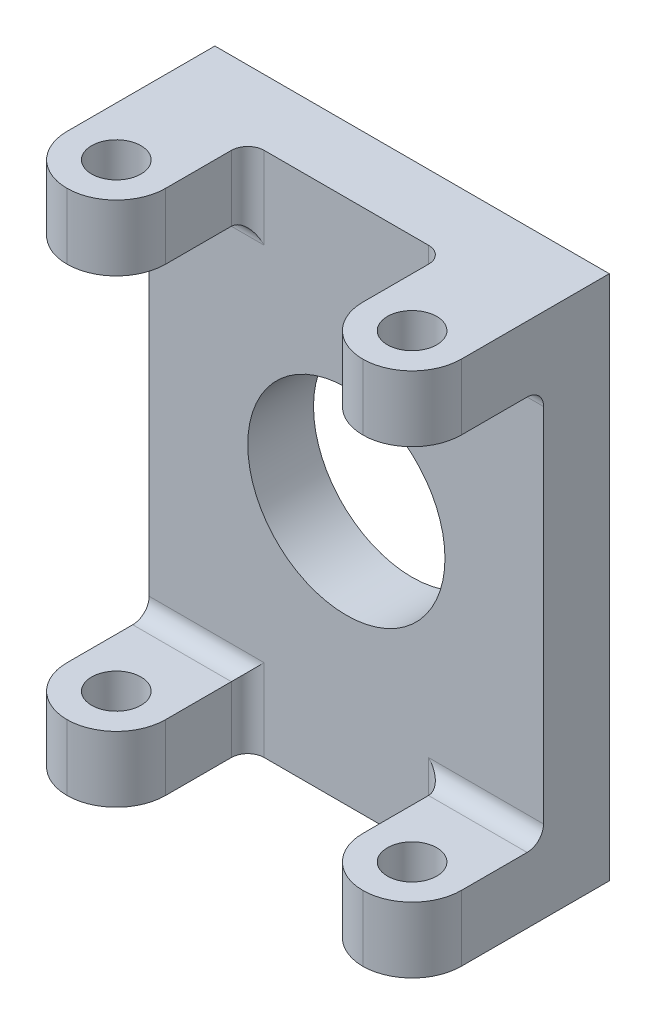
ISO-10303-21;
HEADER;
FILE_DESCRIPTION(('STEP AP214'),'2;1');
FILE_NAME('part.step','',(''),(''),'','','');
FILE_SCHEMA(('AUTOMOTIVE_DESIGN { 1 0 10303 214 1 1 1 1 }'));
ENDSEC;
DATA;
#1=APPLICATION_CONTEXT('core data for automotive mechanical design processes');
#2=APPLICATION_PROTOCOL_DEFINITION('international standard','automotive_design',2000,#1);
#3=PRODUCT_CONTEXT('',#1,'mechanical');
#4=PRODUCT('Part','Part','',(#3));
#5=PRODUCT_RELATED_PRODUCT_CATEGORY('part','',(#4));
#6=PRODUCT_DEFINITION_FORMATION('','',#4);
#7=PRODUCT_DEFINITION_CONTEXT('part definition',#1,'design');
#8=PRODUCT_DEFINITION('design','',#6,#7);
#9=PRODUCT_DEFINITION_SHAPE('','',#8);
#10=(LENGTH_UNIT() NAMED_UNIT(*) SI_UNIT(.MILLI.,.METRE.));
#11=(NAMED_UNIT(*) PLANE_ANGLE_UNIT() SI_UNIT($,.RADIAN.));
#12=(NAMED_UNIT(*) SI_UNIT($,.STERADIAN.) SOLID_ANGLE_UNIT());
#13=UNCERTAINTY_MEASURE_WITH_UNIT(LENGTH_MEASURE(1.E-05),#10,'distance_accuracy_value','');
#14=(GEOMETRIC_REPRESENTATION_CONTEXT(3) GLOBAL_UNCERTAINTY_ASSIGNED_CONTEXT((#13)) GLOBAL_UNIT_ASSIGNED_CONTEXT((#10,
#11,#12)) REPRESENTATION_CONTEXT('',''));
#15=CARTESIAN_POINT('',(0.,0.,0.));
#16=DIRECTION('',(0.,0.,1.));
#17=DIRECTION('',(1.,0.,0.));
#18=AXIS2_PLACEMENT_3D('',#15,#16,#17);
#19=CARTESIAN_POINT('',(-76.2,-101.6,25.4));
#20=DIRECTION('',(0.,0.,-1.));
#21=DIRECTION('',(-1.,0.,0.));
#22=AXIS2_PLACEMENT_3D('',#19,#20,#21);
#23=PLANE('',#22);
#24=CARTESIAN_POINT('',(0.,0.,25.4));
#25=DIRECTION('',(0.,0.,-1.));
#26=DIRECTION('',(-1.,0.,0.));
#27=AXIS2_PLACEMENT_3D('',#24,#25,#26);
#28=CIRCLE('',#27,38.1);
#29=CARTESIAN_POINT('',(-38.1,0.,25.4));
#30=VERTEX_POINT('',#29);
#31=EDGE_CURVE('E416',#30,#30,#28,.T.);
#32=ORIENTED_EDGE('',*,*,#31,.T.);
#33=EDGE_LOOP('',(#32));
#34=FACE_BOUND('',#33,.T.);
#35=DIRECTION('',(0.,1.,0.));
#36=VECTOR('',#35,1.);
#37=CARTESIAN_POINT('',(31.75,-101.6,25.4));
#38=LINE('',#37,#36);
#39=CARTESIAN_POINT('',(31.75,-101.6,25.4));
#40=VERTEX_POINT('',#39);
#41=CARTESIAN_POINT('',(31.75,-69.85,25.4));
#42=VERTEX_POINT('',#41);
#43=EDGE_CURVE('E361',#40,#42,#38,.T.);
#44=ORIENTED_EDGE('',*,*,#43,.T.);
#45=DIRECTION('',(1.,0.,0.));
#46=VECTOR('',#45,1.);
#47=CARTESIAN_POINT('',(-76.2,-69.85,25.4));
#48=LINE('',#47,#46);
#49=CARTESIAN_POINT('',(76.2,-69.85,25.4));
#50=VERTEX_POINT('',#49);
#51=EDGE_CURVE('E372',#42,#50,#48,.T.);
#52=ORIENTED_EDGE('',*,*,#51,.T.);
#53=DIRECTION('',(0.,1.,0.));
#54=VECTOR('',#53,1.);
#55=CARTESIAN_POINT('',(76.2,-101.6,25.4));
#56=LINE('',#55,#54);
#57=CARTESIAN_POINT('',(76.2,69.85,25.4));
#58=VERTEX_POINT('',#57);
#59=EDGE_CURVE('E352',#50,#58,#56,.T.);
#60=ORIENTED_EDGE('',*,*,#59,.T.);
#61=DIRECTION('',(1.,0.,0.));
#62=VECTOR('',#61,1.);
#63=CARTESIAN_POINT('',(38.1,69.85,25.4));
#64=LINE('',#63,#62);
#65=CARTESIAN_POINT('',(31.75,69.85,25.4));
#66=VERTEX_POINT('',#65);
#67=EDGE_CURVE('E373',#58,#66,#64,.F.);
#68=ORIENTED_EDGE('',*,*,#67,.T.);
#69=DIRECTION('',(0.,-1.,0.));
#70=VECTOR('',#69,1.);
#71=CARTESIAN_POINT('',(31.75,101.6,25.4));
#72=LINE('',#71,#70);
#73=CARTESIAN_POINT('',(31.75,101.6,25.4));
#74=VERTEX_POINT('',#73);
#75=EDGE_CURVE('E377',#66,#74,#72,.F.);
#76=ORIENTED_EDGE('',*,*,#75,.T.);
#77=DIRECTION('',(-1.,0.,0.));
#78=VECTOR('',#77,1.);
#79=CARTESIAN_POINT('',(-76.2,101.6,25.4));
#80=LINE('',#79,#78);
#81=CARTESIAN_POINT('',(-31.75,101.6,25.4));
#82=VERTEX_POINT('',#81);
#83=EDGE_CURVE('E240',#74,#82,#80,.T.);
#84=ORIENTED_EDGE('',*,*,#83,.T.);
#85=DIRECTION('',(0.,-1.,0.));
#86=VECTOR('',#85,1.);
#87=CARTESIAN_POINT('',(-31.75,-101.6,25.4));
#88=LINE('',#87,#86);
#89=CARTESIAN_POINT('',(-31.75,69.85,25.4));
#90=VERTEX_POINT('',#89);
#91=EDGE_CURVE('E631',#82,#90,#88,.T.);
#92=ORIENTED_EDGE('',*,*,#91,.T.);
#93=DIRECTION('',(-1.,0.,0.));
#94=VECTOR('',#93,1.);
#95=CARTESIAN_POINT('',(-76.2,69.85,25.4));
#96=LINE('',#95,#94);
#97=CARTESIAN_POINT('',(-76.2,69.85,25.4));
#98=VERTEX_POINT('',#97);
#99=EDGE_CURVE('E629',#90,#98,#96,.T.);
#100=ORIENTED_EDGE('',*,*,#99,.T.);
#101=DIRECTION('',(0.,-1.,0.));
#102=VECTOR('',#101,1.);
#103=CARTESIAN_POINT('',(-76.2,-101.6,25.4));
#104=LINE('',#103,#102);
#105=CARTESIAN_POINT('',(-76.2,-69.85,25.4));
#106=VERTEX_POINT('',#105);
#107=EDGE_CURVE('E246',#98,#106,#104,.T.);
#108=ORIENTED_EDGE('',*,*,#107,.T.);
#109=DIRECTION('',(-1.,0.,0.));
#110=VECTOR('',#109,1.);
#111=CARTESIAN_POINT('',(-38.1,-69.85,25.4));
#112=LINE('',#111,#110);
#113=CARTESIAN_POINT('',(-31.75,-69.85,25.4));
#114=VERTEX_POINT('',#113);
#115=EDGE_CURVE('E626',#106,#114,#112,.F.);
#116=ORIENTED_EDGE('',*,*,#115,.T.);
#117=DIRECTION('',(0.,1.,0.));
#118=VECTOR('',#117,1.);
#119=CARTESIAN_POINT('',(-31.75,-101.6,25.4));
#120=LINE('',#119,#118);
#121=CARTESIAN_POINT('',(-31.75,-101.6,25.4));
#122=VERTEX_POINT('',#121);
#123=EDGE_CURVE('E341',#114,#122,#120,.F.);
#124=ORIENTED_EDGE('',*,*,#123,.T.);
#125=DIRECTION('',(1.,0.,0.));
#126=VECTOR('',#125,1.);
#127=CARTESIAN_POINT('',(-76.2,-101.6,25.4));
#128=LINE('',#127,#126);
#129=EDGE_CURVE('E345',#122,#40,#128,.T.);
#130=ORIENTED_EDGE('',*,*,#129,.T.);
#131=EDGE_LOOP('',(#44,#52,#60,#68,#76,#84,#92,#100,#108,#116,#124,#130));
#132=FACE_BOUND('',#131,.T.);
#133=ADVANCED_FACE('F31',(#34,#132),#23,.F.);
#134=CARTESIAN_POINT('',(-76.2,101.6,25.4));
#135=DIRECTION('',(0.,-1.,0.));
#136=DIRECTION('',(1.,0.,0.));
#137=AXIS2_PLACEMENT_3D('',#134,#135,#136);
#138=PLANE('',#137);
#139=CARTESIAN_POINT('',(57.15,101.6,57.15));
#140=DIRECTION('',(0.,1.,0.));
#141=DIRECTION('',(-1.,0.,0.));
#142=AXIS2_PLACEMENT_3D('',#139,#140,#141);
#143=CIRCLE('',#142,9.525);
#144=CARTESIAN_POINT('',(47.625,101.6,57.15));
#145=VERTEX_POINT('',#144);
#146=EDGE_CURVE('E338',#145,#145,#143,.T.);
#147=ORIENTED_EDGE('',*,*,#146,.F.);
#148=EDGE_LOOP('',(#147));
#149=FACE_BOUND('',#148,.T.);
#150=DIRECTION('',(0.,0.,-1.));
#151=VECTOR('',#150,1.);
#152=CARTESIAN_POINT('',(38.1,101.6,76.2));
#153=LINE('',#152,#151);
#154=CARTESIAN_POINT('',(38.1,101.6,57.15));
#155=VERTEX_POINT('',#154);
#156=CARTESIAN_POINT('',(38.1,101.6,31.75));
#157=VERTEX_POINT('',#156);
#158=EDGE_CURVE('E435',#155,#157,#153,.T.);
#159=ORIENTED_EDGE('',*,*,#158,.F.);
#160=CARTESIAN_POINT('',(57.15,101.6,57.15));
#161=DIRECTION('',(0.,-1.,0.));
#162=DIRECTION('',(1.,0.,0.));
#163=AXIS2_PLACEMENT_3D('',#160,#161,#162);
#164=CIRCLE('',#163,19.05);
#165=CARTESIAN_POINT('',(57.15,101.6,76.2));
#166=VERTEX_POINT('',#165);
#167=EDGE_CURVE('E326',#155,#166,#164,.F.);
#168=ORIENTED_EDGE('',*,*,#167,.T.);
#169=CARTESIAN_POINT('',(57.15,101.6,57.15));
#170=DIRECTION('',(0.,-1.,0.));
#171=DIRECTION('',(1.,0.,0.));
#172=AXIS2_PLACEMENT_3D('',#169,#170,#171);
#173=CIRCLE('',#172,19.05);
#174=CARTESIAN_POINT('',(76.2,101.6,57.15));
#175=VERTEX_POINT('',#174);
#176=EDGE_CURVE('E324',#166,#175,#173,.F.);
#177=ORIENTED_EDGE('',*,*,#176,.T.);
#178=DIRECTION('',(0.,0.,-1.));
#179=VECTOR('',#178,1.);
#180=CARTESIAN_POINT('',(76.2,101.6,25.4));
#181=LINE('',#180,#179);
#182=CARTESIAN_POINT('',(76.2,101.6,0.));
#183=VERTEX_POINT('',#182);
#184=EDGE_CURVE('E248',#175,#183,#181,.T.);
#185=ORIENTED_EDGE('',*,*,#184,.T.);
#186=DIRECTION('',(-1.,0.,0.));
#187=VECTOR('',#186,1.);
#188=CARTESIAN_POINT('',(-76.2,101.6,0.));
#189=LINE('',#188,#187);
#190=CARTESIAN_POINT('',(-76.2,101.6,0.));
#191=VERTEX_POINT('',#190);
#192=EDGE_CURVE('E244',#183,#191,#189,.T.);
#193=ORIENTED_EDGE('',*,*,#192,.T.);
#194=DIRECTION('',(0.,0.,-1.));
#195=VECTOR('',#194,1.);
#196=CARTESIAN_POINT('',(-76.2,101.6,25.4));
#197=LINE('',#196,#195);
#198=CARTESIAN_POINT('',(-76.2,101.6,57.15));
#199=VERTEX_POINT('',#198);
#200=EDGE_CURVE('E233',#199,#191,#197,.T.);
#201=ORIENTED_EDGE('',*,*,#200,.F.);
#202=CARTESIAN_POINT('',(-57.15,101.6,57.15));
#203=DIRECTION('',(0.,-1.,0.));
#204=DIRECTION('',(1.,0.,0.));
#205=AXIS2_PLACEMENT_3D('',#202,#203,#204);
#206=CIRCLE('',#205,19.05);
#207=CARTESIAN_POINT('',(-57.15,101.6,76.2));
#208=VERTEX_POINT('',#207);
#209=EDGE_CURVE('E303',#199,#208,#206,.F.);
#210=ORIENTED_EDGE('',*,*,#209,.T.);
#211=CARTESIAN_POINT('',(-57.15,101.6,57.15));
#212=DIRECTION('',(0.,-1.,0.));
#213=DIRECTION('',(1.,0.,0.));
#214=AXIS2_PLACEMENT_3D('',#211,#212,#213);
#215=CIRCLE('',#214,19.05);
#216=CARTESIAN_POINT('',(-38.1,101.6,57.15));
#217=VERTEX_POINT('',#216);
#218=EDGE_CURVE('E305',#208,#217,#215,.F.);
#219=ORIENTED_EDGE('',*,*,#218,.T.);
#220=DIRECTION('',(0.,0.,-1.));
#221=VECTOR('',#220,1.);
#222=CARTESIAN_POINT('',(-38.1,101.6,76.2));
#223=LINE('',#222,#221);
#224=CARTESIAN_POINT('',(-38.1,101.6,31.75));
#225=VERTEX_POINT('',#224);
#226=EDGE_CURVE('E313',#217,#225,#223,.T.);
#227=ORIENTED_EDGE('',*,*,#226,.T.);
#228=CARTESIAN_POINT('',(-31.75,101.6,31.75));
#229=DIRECTION('',(0.,-1.,0.));
#230=DIRECTION('',(1.,0.,0.));
#231=AXIS2_PLACEMENT_3D('',#228,#229,#230);
#232=CIRCLE('',#231,6.35);
#233=EDGE_CURVE('E40',#225,#82,#232,.T.);
#234=ORIENTED_EDGE('',*,*,#233,.T.);
#235=ORIENTED_EDGE('',*,*,#83,.F.);
#236=CARTESIAN_POINT('',(31.75,101.6,31.75));
#237=DIRECTION('',(0.,-1.,0.));
#238=DIRECTION('',(1.,0.,0.));
#239=AXIS2_PLACEMENT_3D('',#236,#237,#238);
#240=CIRCLE('',#239,6.35);
#241=EDGE_CURVE('E403',#74,#157,#240,.T.);
#242=ORIENTED_EDGE('',*,*,#241,.T.);
#243=EDGE_LOOP('',(#159,#168,#177,#185,#193,#201,#210,#219,#227,#234,#235,#242));
#244=FACE_BOUND('',#243,.T.);
#245=CARTESIAN_POINT('',(-57.15,101.6,57.15));
#246=DIRECTION('',(0.,-1.,0.));
#247=DIRECTION('',(1.,0.,0.));
#248=AXIS2_PLACEMENT_3D('',#245,#246,#247);
#249=CIRCLE('',#248,9.525);
#250=CARTESIAN_POINT('',(-47.625,101.6,57.15));
#251=VERTEX_POINT('',#250);
#252=EDGE_CURVE('E317',#251,#251,#249,.T.);
#253=ORIENTED_EDGE('',*,*,#252,.T.);
#254=EDGE_LOOP('',(#253));
#255=FACE_BOUND('',#254,.T.);
#256=ADVANCED_FACE('F486',(#149,#244,#255),#138,.F.);
#257=CARTESIAN_POINT('',(-76.2,76.2,76.2));
#258=DIRECTION('',(0.,-1.,0.));
#259=DIRECTION('',(0.,0.,-1.));
#260=AXIS2_PLACEMENT_3D('',#257,#258,#259);
#261=PLANE('',#260);
#262=DIRECTION('',(0.,0.,-1.));
#263=VECTOR('',#262,1.);
#264=CARTESIAN_POINT('',(-76.2,76.2,76.2));
#265=LINE('',#264,#263);
#266=CARTESIAN_POINT('',(-76.2,76.2,57.15));
#267=VERTEX_POINT('',#266);
#268=CARTESIAN_POINT('',(-76.2,76.2,31.75));
#269=VERTEX_POINT('',#268);
#270=EDGE_CURVE('E443',#267,#269,#265,.T.);
#271=ORIENTED_EDGE('',*,*,#270,.T.);
#272=DIRECTION('',(-1.,0.,0.));
#273=VECTOR('',#272,1.);
#274=CARTESIAN_POINT('',(-76.2,76.2,31.75));
#275=LINE('',#274,#273);
#276=CARTESIAN_POINT('',(-38.1,76.2,31.75));
#277=VERTEX_POINT('',#276);
#278=EDGE_CURVE('E382',#269,#277,#275,.F.);
#279=ORIENTED_EDGE('',*,*,#278,.T.);
#280=DIRECTION('',(0.,0.,-1.));
#281=VECTOR('',#280,1.);
#282=CARTESIAN_POINT('',(-38.1,76.2,76.2));
#283=LINE('',#282,#281);
#284=CARTESIAN_POINT('',(-38.1,76.2,57.15));
#285=VERTEX_POINT('',#284);
#286=EDGE_CURVE('E441',#285,#277,#283,.T.);
#287=ORIENTED_EDGE('',*,*,#286,.F.);
#288=CARTESIAN_POINT('',(-57.15,76.2,57.15));
#289=DIRECTION('',(0.,-1.,0.));
#290=DIRECTION('',(0.,0.,-1.));
#291=AXIS2_PLACEMENT_3D('',#288,#289,#290);
#292=CIRCLE('',#291,19.05);
#293=CARTESIAN_POINT('',(-57.15,76.2,76.2));
#294=VERTEX_POINT('',#293);
#295=EDGE_CURVE('E301',#285,#294,#292,.T.);
#296=ORIENTED_EDGE('',*,*,#295,.T.);
#297=CARTESIAN_POINT('',(-57.15,76.2,57.15));
#298=DIRECTION('',(0.,-1.,0.));
#299=DIRECTION('',(0.,0.,-1.));
#300=AXIS2_PLACEMENT_3D('',#297,#298,#299);
#301=CIRCLE('',#300,19.05);
#302=EDGE_CURVE('E299',#294,#267,#301,.T.);
#303=ORIENTED_EDGE('',*,*,#302,.T.);
#304=EDGE_LOOP('',(#271,#279,#287,#296,#303));
#305=FACE_BOUND('',#304,.T.);
#306=CARTESIAN_POINT('',(-57.15,76.2,57.15));
#307=DIRECTION('',(0.,-1.,0.));
#308=DIRECTION('',(0.,0.,-1.));
#309=AXIS2_PLACEMENT_3D('',#306,#307,#308);
#310=CIRCLE('',#309,9.525);
#311=CARTESIAN_POINT('',(-57.15,76.2,47.625));
#312=VERTEX_POINT('',#311);
#313=EDGE_CURVE('E314',#312,#312,#310,.F.);
#314=ORIENTED_EDGE('',*,*,#313,.T.);
#315=EDGE_LOOP('',(#314));
#316=FACE_BOUND('',#315,.T.);
#317=ADVANCED_FACE('F463',(#305,#316),#261,.T.);
#318=CARTESIAN_POINT('',(-76.2,-101.6,25.4));
#319=DIRECTION('',(0.,1.,0.));
#320=DIRECTION('',(0.,0.,1.));
#321=AXIS2_PLACEMENT_3D('',#318,#319,#320);
#322=PLANE('',#321);
#323=CARTESIAN_POINT('',(57.15,-101.6,57.15));
#324=DIRECTION('',(0.,1.,0.));
#325=DIRECTION('',(0.,0.,1.));
#326=AXIS2_PLACEMENT_3D('',#323,#324,#325);
#327=CIRCLE('',#326,19.05);
#328=CARTESIAN_POINT('',(76.2,-101.6,57.15));
#329=VERTEX_POINT('',#328);
#330=CARTESIAN_POINT('',(57.15,-101.6,76.2));
#331=VERTEX_POINT('',#330);
#332=EDGE_CURVE('E282',#329,#331,#327,.F.);
#333=ORIENTED_EDGE('',*,*,#332,.T.);
#334=CARTESIAN_POINT('',(57.15,-101.6,57.15));
#335=DIRECTION('',(0.,1.,0.));
#336=DIRECTION('',(0.,0.,1.));
#337=AXIS2_PLACEMENT_3D('',#334,#335,#336);
#338=CIRCLE('',#337,19.05);
#339=CARTESIAN_POINT('',(38.1,-101.6,57.15));
#340=VERTEX_POINT('',#339);
#341=EDGE_CURVE('E284',#331,#340,#338,.F.);
#342=ORIENTED_EDGE('',*,*,#341,.T.);
#343=DIRECTION('',(0.,0.,-1.));
#344=VECTOR('',#343,1.);
#345=CARTESIAN_POINT('',(38.1,-101.6,76.2));
#346=LINE('',#345,#344);
#347=CARTESIAN_POINT('',(38.1,-101.6,31.75));
#348=VERTEX_POINT('',#347);
#349=EDGE_CURVE('E292',#340,#348,#346,.T.);
#350=ORIENTED_EDGE('',*,*,#349,.T.);
#351=CARTESIAN_POINT('',(31.75,-101.6,31.75));
#352=DIRECTION('',(0.,1.,0.));
#353=DIRECTION('',(0.,0.,1.));
#354=AXIS2_PLACEMENT_3D('',#351,#352,#353);
#355=CIRCLE('',#354,6.35);
#356=EDGE_CURVE('E368',#348,#40,#355,.T.);
#357=ORIENTED_EDGE('',*,*,#356,.T.);
#358=ORIENTED_EDGE('',*,*,#129,.F.);
#359=CARTESIAN_POINT('',(-31.75,-101.6,31.75));
#360=DIRECTION('',(0.,1.,0.));
#361=DIRECTION('',(0.,0.,1.));
#362=AXIS2_PLACEMENT_3D('',#359,#360,#361);
#363=CIRCLE('',#362,6.35);
#364=CARTESIAN_POINT('',(-38.1,-101.6,31.75));
#365=VERTEX_POINT('',#364);
#366=EDGE_CURVE('E11',#122,#365,#363,.T.);
#367=ORIENTED_EDGE('',*,*,#366,.T.);
#368=DIRECTION('',(0.,0.,-1.));
#369=VECTOR('',#368,1.);
#370=CARTESIAN_POINT('',(-38.1,-101.6,76.2));
#371=LINE('',#370,#369);
#372=CARTESIAN_POINT('',(-38.1,-101.6,57.15));
#373=VERTEX_POINT('',#372);
#374=EDGE_CURVE('E235',#373,#365,#371,.T.);
#375=ORIENTED_EDGE('',*,*,#374,.F.);
#376=CARTESIAN_POINT('',(-57.15,-101.6,57.15));
#377=DIRECTION('',(0.,1.,0.));
#378=DIRECTION('',(0.,0.,1.));
#379=AXIS2_PLACEMENT_3D('',#376,#377,#378);
#380=CIRCLE('',#379,19.05);
#381=CARTESIAN_POINT('',(-57.15,-101.6,76.2));
#382=VERTEX_POINT('',#381);
#383=EDGE_CURVE('E263',#373,#382,#380,.F.);
#384=ORIENTED_EDGE('',*,*,#383,.T.);
#385=CARTESIAN_POINT('',(-57.15,-101.6,57.15));
#386=DIRECTION('',(0.,1.,0.));
#387=DIRECTION('',(0.,0.,1.));
#388=AXIS2_PLACEMENT_3D('',#385,#386,#387);
#389=CIRCLE('',#388,19.05);
#390=CARTESIAN_POINT('',(-76.2,-101.6,57.15));
#391=VERTEX_POINT('',#390);
#392=EDGE_CURVE('E215',#382,#391,#389,.F.);
#393=ORIENTED_EDGE('',*,*,#392,.T.);
#394=DIRECTION('',(0.,0.,-1.));
#395=VECTOR('',#394,1.);
#396=CARTESIAN_POINT('',(-76.2,-101.6,25.4));
#397=LINE('',#396,#395);
#398=CARTESIAN_POINT('',(-76.2,-101.6,0.));
#399=VERTEX_POINT('',#398);
#400=EDGE_CURVE('E207',#391,#399,#397,.T.);
#401=ORIENTED_EDGE('',*,*,#400,.T.);
#402=DIRECTION('',(1.,0.,0.));
#403=VECTOR('',#402,1.);
#404=CARTESIAN_POINT('',(-76.2,-101.6,0.));
#405=LINE('',#404,#403);
#406=CARTESIAN_POINT('',(76.2,-101.6,0.));
#407=VERTEX_POINT('',#406);
#408=EDGE_CURVE('E212',#399,#407,#405,.T.);
#409=ORIENTED_EDGE('',*,*,#408,.T.);
#410=DIRECTION('',(0.,0.,-1.));
#411=VECTOR('',#410,1.);
#412=CARTESIAN_POINT('',(76.2,-101.6,25.4));
#413=LINE('',#412,#411);
#414=EDGE_CURVE('E220',#329,#407,#413,.T.);
#415=ORIENTED_EDGE('',*,*,#414,.F.);
#416=EDGE_LOOP('',(#333,#342,#350,#357,#358,#367,#375,#384,#393,#401,#409,#415));
#417=FACE_BOUND('',#416,.T.);
#418=CARTESIAN_POINT('',(-57.15,-101.6,57.15));
#419=DIRECTION('',(0.,-1.,0.));
#420=DIRECTION('',(1.,0.,0.));
#421=AXIS2_PLACEMENT_3D('',#418,#419,#420);
#422=CIRCLE('',#421,9.525);
#423=CARTESIAN_POINT('',(-47.625,-101.6,57.15));
#424=VERTEX_POINT('',#423);
#425=EDGE_CURVE('E275',#424,#424,#422,.T.);
#426=ORIENTED_EDGE('',*,*,#425,.F.);
#427=EDGE_LOOP('',(#426));
#428=FACE_BOUND('',#427,.T.);
#429=CARTESIAN_POINT('',(57.15,-101.6,57.15));
#430=DIRECTION('',(0.,1.,0.));
#431=DIRECTION('',(-1.,0.,0.));
#432=AXIS2_PLACEMENT_3D('',#429,#430,#431);
#433=CIRCLE('',#432,9.525);
#434=CARTESIAN_POINT('',(47.625,-101.6,57.15));
#435=VERTEX_POINT('',#434);
#436=EDGE_CURVE('E296',#435,#435,#433,.T.);
#437=ORIENTED_EDGE('',*,*,#436,.T.);
#438=EDGE_LOOP('',(#437));
#439=FACE_BOUND('',#438,.T.);
#440=ADVANCED_FACE('F209',(#417,#428,#439),#322,.F.);
#441=CARTESIAN_POINT('',(76.2,-76.2,76.2));
#442=DIRECTION('',(0.,1.,0.));
#443=DIRECTION('',(0.,0.,1.));
#444=AXIS2_PLACEMENT_3D('',#441,#442,#443);
#445=PLANE('',#444);
#446=DIRECTION('',(0.,0.,-1.));
#447=VECTOR('',#446,1.);
#448=CARTESIAN_POINT('',(76.2,-76.2,76.2));
#449=LINE('',#448,#447);
#450=CARTESIAN_POINT('',(76.2,-76.2,57.15));
#451=VERTEX_POINT('',#450);
#452=CARTESIAN_POINT('',(76.2,-76.2,31.75));
#453=VERTEX_POINT('',#452);
#454=EDGE_CURVE('E453',#451,#453,#449,.T.);
#455=ORIENTED_EDGE('',*,*,#454,.T.);
#456=DIRECTION('',(1.,0.,0.));
#457=VECTOR('',#456,1.);
#458=CARTESIAN_POINT('',(76.2,-76.2,31.75));
#459=LINE('',#458,#457);
#460=CARTESIAN_POINT('',(38.1,-76.2,31.75));
#461=VERTEX_POINT('',#460);
#462=EDGE_CURVE('E375',#453,#461,#459,.F.);
#463=ORIENTED_EDGE('',*,*,#462,.T.);
#464=DIRECTION('',(0.,0.,-1.));
#465=VECTOR('',#464,1.);
#466=CARTESIAN_POINT('',(38.1,-76.2,76.2));
#467=LINE('',#466,#465);
#468=CARTESIAN_POINT('',(38.1,-76.2,57.15));
#469=VERTEX_POINT('',#468);
#470=EDGE_CURVE('E450',#469,#461,#467,.T.);
#471=ORIENTED_EDGE('',*,*,#470,.F.);
#472=CARTESIAN_POINT('',(57.15,-76.2,57.15));
#473=DIRECTION('',(0.,1.,0.));
#474=DIRECTION('',(0.,0.,1.));
#475=AXIS2_PLACEMENT_3D('',#472,#473,#474);
#476=CIRCLE('',#475,19.05);
#477=CARTESIAN_POINT('',(57.15,-76.2,76.2));
#478=VERTEX_POINT('',#477);
#479=EDGE_CURVE('E280',#469,#478,#476,.T.);
#480=ORIENTED_EDGE('',*,*,#479,.T.);
#481=CARTESIAN_POINT('',(57.15,-76.2,57.15));
#482=DIRECTION('',(0.,1.,0.));
#483=DIRECTION('',(0.,0.,1.));
#484=AXIS2_PLACEMENT_3D('',#481,#482,#483);
#485=CIRCLE('',#484,19.05);
#486=EDGE_CURVE('E278',#478,#451,#485,.T.);
#487=ORIENTED_EDGE('',*,*,#486,.T.);
#488=EDGE_LOOP('',(#455,#463,#471,#480,#487));
#489=FACE_BOUND('',#488,.T.);
#490=CARTESIAN_POINT('',(57.15,-76.2,57.15));
#491=DIRECTION('',(0.,1.,0.));
#492=DIRECTION('',(0.,0.,1.));
#493=AXIS2_PLACEMENT_3D('',#490,#491,#492);
#494=CIRCLE('',#493,9.525);
#495=CARTESIAN_POINT('',(57.15,-76.2,66.675));
#496=VERTEX_POINT('',#495);
#497=EDGE_CURVE('E293',#496,#496,#494,.F.);
#498=ORIENTED_EDGE('',*,*,#497,.T.);
#499=EDGE_LOOP('',(#498));
#500=FACE_BOUND('',#499,.T.);
#501=ADVANCED_FACE('F462',(#489,#500),#445,.T.);
#502=CARTESIAN_POINT('',(-76.2,-101.6,25.4));
#503=DIRECTION('',(1.,0.,0.));
#504=DIRECTION('',(0.,1.,0.));
#505=AXIS2_PLACEMENT_3D('',#502,#503,#504);
#506=PLANE('',#505);
#507=ORIENTED_EDGE('',*,*,#270,.F.);
#508=DIRECTION('',(0.,1.,0.));
#509=VECTOR('',#508,1.);
#510=CARTESIAN_POINT('',(-76.2,-101.6,57.15));
#511=LINE('',#510,#509);
#512=EDGE_CURVE('E307',#267,#199,#511,.T.);
#513=ORIENTED_EDGE('',*,*,#512,.T.);
#514=ORIENTED_EDGE('',*,*,#200,.T.);
#515=DIRECTION('',(0.,-1.,0.));
#516=VECTOR('',#515,1.);
#517=CARTESIAN_POINT('',(-76.2,-101.6,0.));
#518=LINE('',#517,#516);
#519=EDGE_CURVE('E226',#191,#399,#518,.T.);
#520=ORIENTED_EDGE('',*,*,#519,.T.);
#521=ORIENTED_EDGE('',*,*,#400,.F.);
#522=DIRECTION('',(0.,-1.,0.));
#523=VECTOR('',#522,1.);
#524=CARTESIAN_POINT('',(-76.2,-101.6,57.15));
#525=LINE('',#524,#523);
#526=CARTESIAN_POINT('',(-76.2,-76.2,57.15));
#527=VERTEX_POINT('',#526);
#528=EDGE_CURVE('E265',#391,#527,#525,.F.);
#529=ORIENTED_EDGE('',*,*,#528,.T.);
#530=DIRECTION('',(0.,0.,-1.));
#531=VECTOR('',#530,1.);
#532=CARTESIAN_POINT('',(-76.2,-76.2,76.2));
#533=LINE('',#532,#531);
#534=CARTESIAN_POINT('',(-76.2,-76.2,31.75));
#535=VERTEX_POINT('',#534);
#536=EDGE_CURVE('E271',#527,#535,#533,.T.);
#537=ORIENTED_EDGE('',*,*,#536,.T.);
#538=CARTESIAN_POINT('',(-76.2,-69.85,31.75));
#539=DIRECTION('',(1.,0.,0.));
#540=DIRECTION('',(0.,1.,0.));
#541=AXIS2_PLACEMENT_3D('',#538,#539,#540);
#542=CIRCLE('',#541,6.35);
#543=EDGE_CURVE('E394',#535,#106,#542,.T.);
#544=ORIENTED_EDGE('',*,*,#543,.T.);
#545=ORIENTED_EDGE('',*,*,#107,.F.);
#546=CARTESIAN_POINT('',(-76.2,69.85,31.75));
#547=DIRECTION('',(1.,0.,0.));
#548=DIRECTION('',(0.,1.,0.));
#549=AXIS2_PLACEMENT_3D('',#546,#547,#548);
#550=CIRCLE('',#549,6.35);
#551=EDGE_CURVE('E398',#98,#269,#550,.T.);
#552=ORIENTED_EDGE('',*,*,#551,.T.);
#553=EDGE_LOOP('',(#507,#513,#514,#520,#521,#529,#537,#544,#545,#552));
#554=FACE_BOUND('',#553,.T.);
#555=ADVANCED_FACE('F231',(#554),#506,.F.);
#556=CARTESIAN_POINT('',(76.2,-101.6,25.4));
#557=DIRECTION('',(-1.,0.,0.));
#558=DIRECTION('',(0.,0.,1.));
#559=AXIS2_PLACEMENT_3D('',#556,#557,#558);
#560=PLANE('',#559);
#561=ORIENTED_EDGE('',*,*,#184,.F.);
#562=DIRECTION('',(0.,1.,0.));
#563=VECTOR('',#562,1.);
#564=CARTESIAN_POINT('',(76.2,-101.6,57.15));
#565=LINE('',#564,#563);
#566=CARTESIAN_POINT('',(76.2,76.2,57.15));
#567=VERTEX_POINT('',#566);
#568=EDGE_CURVE('E328',#175,#567,#565,.F.);
#569=ORIENTED_EDGE('',*,*,#568,.T.);
#570=DIRECTION('',(0.,0.,-1.));
#571=VECTOR('',#570,1.);
#572=CARTESIAN_POINT('',(76.2,76.2,76.2));
#573=LINE('',#572,#571);
#574=CARTESIAN_POINT('',(76.2,76.2,31.75));
#575=VERTEX_POINT('',#574);
#576=EDGE_CURVE('E334',#567,#575,#573,.T.);
#577=ORIENTED_EDGE('',*,*,#576,.T.);
#578=CARTESIAN_POINT('',(76.2,69.85,31.75));
#579=DIRECTION('',(-1.,0.,0.));
#580=DIRECTION('',(0.,0.,1.));
#581=AXIS2_PLACEMENT_3D('',#578,#579,#580);
#582=CIRCLE('',#581,6.35);
#583=EDGE_CURVE('E400',#575,#58,#582,.T.);
#584=ORIENTED_EDGE('',*,*,#583,.T.);
#585=ORIENTED_EDGE('',*,*,#59,.F.);
#586=CARTESIAN_POINT('',(76.2,-69.85,31.75));
#587=DIRECTION('',(-1.,0.,0.));
#588=DIRECTION('',(0.,0.,1.));
#589=AXIS2_PLACEMENT_3D('',#586,#587,#588);
#590=CIRCLE('',#589,6.35);
#591=EDGE_CURVE('E396',#50,#453,#590,.T.);
#592=ORIENTED_EDGE('',*,*,#591,.T.);
#593=ORIENTED_EDGE('',*,*,#454,.F.);
#594=DIRECTION('',(0.,-1.,0.));
#595=VECTOR('',#594,1.);
#596=CARTESIAN_POINT('',(76.2,-101.6,57.15));
#597=LINE('',#596,#595);
#598=EDGE_CURVE('E286',#451,#329,#597,.T.);
#599=ORIENTED_EDGE('',*,*,#598,.T.);
#600=ORIENTED_EDGE('',*,*,#414,.T.);
#601=DIRECTION('',(0.,1.,0.));
#602=VECTOR('',#601,1.);
#603=CARTESIAN_POINT('',(76.2,-101.6,0.));
#604=LINE('',#603,#602);
#605=EDGE_CURVE('E228',#407,#183,#604,.T.);
#606=ORIENTED_EDGE('',*,*,#605,.T.);
#607=EDGE_LOOP('',(#561,#569,#577,#584,#585,#592,#593,#599,#600,#606));
#608=FACE_BOUND('',#607,.T.);
#609=ADVANCED_FACE('F498',(#608),#560,.F.);
#610=CARTESIAN_POINT('',(-76.2,-101.6,0.));
#611=DIRECTION('',(0.,0.,-1.));
#612=DIRECTION('',(-1.,0.,0.));
#613=AXIS2_PLACEMENT_3D('',#610,#611,#612);
#614=PLANE('',#613);
#615=CARTESIAN_POINT('',(0.,0.,0.));
#616=DIRECTION('',(0.,0.,-1.));
#617=DIRECTION('',(-1.,0.,0.));
#618=AXIS2_PLACEMENT_3D('',#615,#616,#617);
#619=CIRCLE('',#618,38.1);
#620=CARTESIAN_POINT('',(-38.1,0.,0.));
#621=VERTEX_POINT('',#620);
#622=EDGE_CURVE('E421',#621,#621,#619,.T.);
#623=ORIENTED_EDGE('',*,*,#622,.F.);
#624=EDGE_LOOP('',(#623));
#625=FACE_BOUND('',#624,.T.);
#626=ORIENTED_EDGE('',*,*,#519,.F.);
#627=ORIENTED_EDGE('',*,*,#192,.F.);
#628=ORIENTED_EDGE('',*,*,#605,.F.);
#629=ORIENTED_EDGE('',*,*,#408,.F.);
#630=EDGE_LOOP('',(#626,#627,#628,#629));
#631=FACE_BOUND('',#630,.T.);
#632=ADVANCED_FACE('F224',(#625,#631),#614,.T.);
#633=CARTESIAN_POINT('',(-38.1,-101.6,76.2));
#634=DIRECTION('',(-1.,0.,0.));
#635=DIRECTION('',(0.,0.,1.));
#636=AXIS2_PLACEMENT_3D('',#633,#634,#635);
#637=PLANE('',#636);
#638=ORIENTED_EDGE('',*,*,#374,.T.);
#639=DIRECTION('',(0.,1.,0.));
#640=VECTOR('',#639,1.);
#641=CARTESIAN_POINT('',(-38.1,-76.2,31.75));
#642=LINE('',#641,#640);
#643=CARTESIAN_POINT('',(-38.1,-76.2,31.75));
#644=VERTEX_POINT('',#643);
#645=EDGE_CURVE('E392',#365,#644,#642,.T.);
#646=ORIENTED_EDGE('',*,*,#645,.T.);
#647=DIRECTION('',(0.,0.,-1.));
#648=VECTOR('',#647,1.);
#649=CARTESIAN_POINT('',(-38.1,-76.2,76.2));
#650=LINE('',#649,#648);
#651=CARTESIAN_POINT('',(-38.1,-76.2,57.15));
#652=VERTEX_POINT('',#651);
#653=EDGE_CURVE('E237',#652,#644,#650,.T.);
#654=ORIENTED_EDGE('',*,*,#653,.F.);
#655=DIRECTION('',(0.,1.,0.));
#656=VECTOR('',#655,1.);
#657=CARTESIAN_POINT('',(-38.1,-101.6,57.15));
#658=LINE('',#657,#656);
#659=EDGE_CURVE('E259',#652,#373,#658,.F.);
#660=ORIENTED_EDGE('',*,*,#659,.T.);
#661=EDGE_LOOP('',(#638,#646,#654,#660));
#662=FACE_BOUND('',#661,.T.);
#663=ADVANCED_FACE('F495',(#662),#637,.F.);
#664=CARTESIAN_POINT('',(-76.2,-76.2,76.2));
#665=DIRECTION('',(0.,-1.,0.));
#666=DIRECTION('',(0.,0.,-1.));
#667=AXIS2_PLACEMENT_3D('',#664,#665,#666);
#668=PLANE('',#667);
#669=CARTESIAN_POINT('',(-57.15,-76.2,57.15));
#670=DIRECTION('',(0.,-1.,0.));
#671=DIRECTION('',(0.,0.,-1.));
#672=AXIS2_PLACEMENT_3D('',#669,#670,#671);
#673=CIRCLE('',#672,9.525);
#674=CARTESIAN_POINT('',(-57.15,-76.2,47.625));
#675=VERTEX_POINT('',#674);
#676=EDGE_CURVE('E272',#675,#675,#673,.T.);
#677=ORIENTED_EDGE('',*,*,#676,.T.);
#678=EDGE_LOOP('',(#677));
#679=FACE_BOUND('',#678,.T.);
#680=ORIENTED_EDGE('',*,*,#653,.T.);
#681=DIRECTION('',(-1.,0.,0.));
#682=VECTOR('',#681,1.);
#683=CARTESIAN_POINT('',(-76.2,-76.2,31.75));
#684=LINE('',#683,#682);
#685=EDGE_CURVE('E330',#644,#535,#684,.T.);
#686=ORIENTED_EDGE('',*,*,#685,.T.);
#687=ORIENTED_EDGE('',*,*,#536,.F.);
#688=CARTESIAN_POINT('',(-57.15,-76.2,57.15));
#689=DIRECTION('',(0.,-1.,0.));
#690=DIRECTION('',(0.,0.,-1.));
#691=AXIS2_PLACEMENT_3D('',#688,#689,#690);
#692=CIRCLE('',#691,19.05);
#693=CARTESIAN_POINT('',(-57.15,-76.2,76.2));
#694=VERTEX_POINT('',#693);
#695=EDGE_CURVE('E219',#527,#694,#692,.F.);
#696=ORIENTED_EDGE('',*,*,#695,.T.);
#697=CARTESIAN_POINT('',(-57.15,-76.2,57.15));
#698=DIRECTION('',(0.,-1.,0.));
#699=DIRECTION('',(0.,0.,-1.));
#700=AXIS2_PLACEMENT_3D('',#697,#698,#699);
#701=CIRCLE('',#700,19.05);
#702=EDGE_CURVE('E257',#694,#652,#701,.F.);
#703=ORIENTED_EDGE('',*,*,#702,.T.);
#704=EDGE_LOOP('',(#680,#686,#687,#696,#703));
#705=FACE_BOUND('',#704,.T.);
#706=ADVANCED_FACE('F512',(#679,#705),#668,.F.);
#707=CARTESIAN_POINT('',(-57.15,-76.2,57.15));
#708=DIRECTION('',(0.,-1.,0.));
#709=DIRECTION('',(1.,0.,0.));
#710=AXIS2_PLACEMENT_3D('',#707,#708,#709);
#711=CYLINDRICAL_SURFACE('',#710,19.05);
#712=ORIENTED_EDGE('',*,*,#528,.F.);
#713=ORIENTED_EDGE('',*,*,#392,.F.);
#714=DIRECTION('',(0.,-1.,0.));
#715=VECTOR('',#714,1.);
#716=CARTESIAN_POINT('',(-57.15,-76.2,76.2));
#717=LINE('',#716,#715);
#718=EDGE_CURVE('E268',#694,#382,#717,.T.);
#719=ORIENTED_EDGE('',*,*,#718,.F.);
#720=ORIENTED_EDGE('',*,*,#695,.F.);
#721=EDGE_LOOP('',(#712,#713,#719,#720));
#722=FACE_BOUND('',#721,.T.);
#723=ADVANCED_FACE('F509',(#722),#711,.T.);
#724=CARTESIAN_POINT('',(-57.15,-76.2,57.15));
#725=DIRECTION('',(0.,1.,0.));
#726=DIRECTION('',(0.,0.,1.));
#727=AXIS2_PLACEMENT_3D('',#724,#725,#726);
#728=CYLINDRICAL_SURFACE('',#727,19.05);
#729=ORIENTED_EDGE('',*,*,#383,.F.);
#730=ORIENTED_EDGE('',*,*,#659,.F.);
#731=ORIENTED_EDGE('',*,*,#702,.F.);
#732=ORIENTED_EDGE('',*,*,#718,.T.);
#733=EDGE_LOOP('',(#729,#730,#731,#732));
#734=FACE_BOUND('',#733,.T.);
#735=ADVANCED_FACE('F506',(#734),#728,.T.);
#736=CARTESIAN_POINT('',(-57.15,101.600025,57.15));
#737=DIRECTION('',(0.,-1.,0.));
#738=DIRECTION('',(1.,0.,0.));
#739=AXIS2_PLACEMENT_3D('',#736,#737,#738);
#740=CYLINDRICAL_SURFACE('',#739,9.525);
#741=ORIENTED_EDGE('',*,*,#425,.T.);
#742=EDGE_LOOP('',(#741));
#743=FACE_BOUND('',#742,.T.);
#744=ORIENTED_EDGE('',*,*,#676,.F.);
#745=EDGE_LOOP('',(#744));
#746=FACE_BOUND('',#745,.T.);
#747=ADVANCED_FACE('F458',(#743,#746),#740,.F.);
#748=CARTESIAN_POINT('',(38.1,-101.6,76.2));
#749=DIRECTION('',(-1.,0.,0.));
#750=DIRECTION('',(0.,0.,1.));
#751=AXIS2_PLACEMENT_3D('',#748,#749,#750);
#752=PLANE('',#751);
#753=ORIENTED_EDGE('',*,*,#470,.T.);
#754=DIRECTION('',(0.,1.,0.));
#755=VECTOR('',#754,1.);
#756=CARTESIAN_POINT('',(38.1,-101.6,31.75));
#757=LINE('',#756,#755);
#758=EDGE_CURVE('E387',#461,#348,#757,.F.);
#759=ORIENTED_EDGE('',*,*,#758,.T.);
#760=ORIENTED_EDGE('',*,*,#349,.F.);
#761=DIRECTION('',(0.,1.,0.));
#762=VECTOR('',#761,1.);
#763=CARTESIAN_POINT('',(38.1,-76.2,57.15));
#764=LINE('',#763,#762);
#765=EDGE_CURVE('E267',#340,#469,#764,.T.);
#766=ORIENTED_EDGE('',*,*,#765,.T.);
#767=EDGE_LOOP('',(#753,#759,#760,#766));
#768=FACE_BOUND('',#767,.T.);
#769=ADVANCED_FACE('F517',(#768),#752,.T.);
#770=CARTESIAN_POINT('',(57.15,-101.6,57.15));
#771=DIRECTION('',(0.,-1.,0.));
#772=DIRECTION('',(0.,0.,-1.));
#773=AXIS2_PLACEMENT_3D('',#770,#771,#772);
#774=CYLINDRICAL_SURFACE('',#773,19.05);
#775=DIRECTION('',(0.,-1.,0.));
#776=VECTOR('',#775,1.);
#777=CARTESIAN_POINT('',(57.15,-76.2,76.2));
#778=LINE('',#777,#776);
#779=EDGE_CURVE('E289',#331,#478,#778,.F.);
#780=ORIENTED_EDGE('',*,*,#779,.F.);
#781=ORIENTED_EDGE('',*,*,#332,.F.);
#782=ORIENTED_EDGE('',*,*,#598,.F.);
#783=ORIENTED_EDGE('',*,*,#486,.F.);
#784=EDGE_LOOP('',(#780,#781,#782,#783));
#785=FACE_BOUND('',#784,.T.);
#786=ADVANCED_FACE('F479',(#785),#774,.T.);
#787=CARTESIAN_POINT('',(57.15,-101.6,57.15));
#788=DIRECTION('',(0.,-1.,0.));
#789=DIRECTION('',(0.,0.,-1.));
#790=AXIS2_PLACEMENT_3D('',#787,#788,#789);
#791=CYLINDRICAL_SURFACE('',#790,19.05);
#792=ORIENTED_EDGE('',*,*,#341,.F.);
#793=ORIENTED_EDGE('',*,*,#779,.T.);
#794=ORIENTED_EDGE('',*,*,#479,.F.);
#795=ORIENTED_EDGE('',*,*,#765,.F.);
#796=EDGE_LOOP('',(#792,#793,#794,#795));
#797=FACE_BOUND('',#796,.T.);
#798=ADVANCED_FACE('F470',(#797),#791,.T.);
#799=CARTESIAN_POINT('',(57.15,101.600025,57.15));
#800=DIRECTION('',(0.,-1.,0.));
#801=DIRECTION('',(1.,0.,0.));
#802=AXIS2_PLACEMENT_3D('',#799,#800,#801);
#803=CYLINDRICAL_SURFACE('',#802,9.525);
#804=ORIENTED_EDGE('',*,*,#497,.F.);
#805=EDGE_LOOP('',(#804));
#806=FACE_BOUND('',#805,.T.);
#807=ORIENTED_EDGE('',*,*,#436,.F.);
#808=EDGE_LOOP('',(#807));
#809=FACE_BOUND('',#808,.T.);
#810=ADVANCED_FACE('F467',(#806,#809),#803,.F.);
#811=CARTESIAN_POINT('',(-38.1,101.6,76.2));
#812=DIRECTION('',(1.,0.,0.));
#813=DIRECTION('',(0.,0.,-1.));
#814=AXIS2_PLACEMENT_3D('',#811,#812,#813);
#815=PLANE('',#814);
#816=ORIENTED_EDGE('',*,*,#286,.T.);
#817=DIRECTION('',(0.,-1.,0.));
#818=VECTOR('',#817,1.);
#819=CARTESIAN_POINT('',(-38.1,101.6,31.75));
#820=LINE('',#819,#818);
#821=EDGE_CURVE('E54',#277,#225,#820,.F.);
#822=ORIENTED_EDGE('',*,*,#821,.T.);
#823=ORIENTED_EDGE('',*,*,#226,.F.);
#824=DIRECTION('',(0.,-1.,0.));
#825=VECTOR('',#824,1.);
#826=CARTESIAN_POINT('',(-38.1,76.2,57.15));
#827=LINE('',#826,#825);
#828=EDGE_CURVE('E288',#217,#285,#827,.T.);
#829=ORIENTED_EDGE('',*,*,#828,.T.);
#830=EDGE_LOOP('',(#816,#822,#823,#829));
#831=FACE_BOUND('',#830,.T.);
#832=ADVANCED_FACE('F469',(#831),#815,.T.);
#833=CARTESIAN_POINT('',(-57.15,-101.6,57.15));
#834=DIRECTION('',(0.,1.,0.));
#835=DIRECTION('',(-1.,0.,0.));
#836=AXIS2_PLACEMENT_3D('',#833,#834,#835);
#837=CYLINDRICAL_SURFACE('',#836,19.05);
#838=DIRECTION('',(0.,1.,0.));
#839=VECTOR('',#838,1.);
#840=CARTESIAN_POINT('',(-57.15,76.2,76.2));
#841=LINE('',#840,#839);
#842=EDGE_CURVE('E310',#208,#294,#841,.F.);
#843=ORIENTED_EDGE('',*,*,#842,.F.);
#844=ORIENTED_EDGE('',*,*,#209,.F.);
#845=ORIENTED_EDGE('',*,*,#512,.F.);
#846=ORIENTED_EDGE('',*,*,#302,.F.);
#847=EDGE_LOOP('',(#843,#844,#845,#846));
#848=FACE_BOUND('',#847,.T.);
#849=ADVANCED_FACE('F477',(#848),#837,.T.);
#850=CARTESIAN_POINT('',(-57.15,101.6,57.15));
#851=DIRECTION('',(0.,1.,0.));
#852=DIRECTION('',(0.,0.,1.));
#853=AXIS2_PLACEMENT_3D('',#850,#851,#852);
#854=CYLINDRICAL_SURFACE('',#853,19.05);
#855=ORIENTED_EDGE('',*,*,#218,.F.);
#856=ORIENTED_EDGE('',*,*,#842,.T.);
#857=ORIENTED_EDGE('',*,*,#295,.F.);
#858=ORIENTED_EDGE('',*,*,#828,.F.);
#859=EDGE_LOOP('',(#855,#856,#857,#858));
#860=FACE_BOUND('',#859,.T.);
#861=ADVANCED_FACE('F519',(#860),#854,.T.);
#862=CARTESIAN_POINT('',(-57.15,-101.60005,57.15));
#863=DIRECTION('',(0.,1.,0.));
#864=DIRECTION('',(-1.,0.,0.));
#865=AXIS2_PLACEMENT_3D('',#862,#863,#864);
#866=CYLINDRICAL_SURFACE('',#865,9.525);
#867=ORIENTED_EDGE('',*,*,#313,.F.);
#868=EDGE_LOOP('',(#867));
#869=FACE_BOUND('',#868,.T.);
#870=ORIENTED_EDGE('',*,*,#252,.F.);
#871=EDGE_LOOP('',(#870));
#872=FACE_BOUND('',#871,.T.);
#873=ADVANCED_FACE('F522',(#869,#872),#866,.F.);
#874=CARTESIAN_POINT('',(38.1,101.6,76.2));
#875=DIRECTION('',(1.,0.,0.));
#876=DIRECTION('',(0.,0.,-1.));
#877=AXIS2_PLACEMENT_3D('',#874,#875,#876);
#878=PLANE('',#877);
#879=ORIENTED_EDGE('',*,*,#158,.T.);
#880=DIRECTION('',(0.,-1.,0.));
#881=VECTOR('',#880,1.);
#882=CARTESIAN_POINT('',(38.1,76.2,31.75));
#883=LINE('',#882,#881);
#884=CARTESIAN_POINT('',(38.1,76.2,31.75));
#885=VERTEX_POINT('',#884);
#886=EDGE_CURVE('E389',#157,#885,#883,.T.);
#887=ORIENTED_EDGE('',*,*,#886,.T.);
#888=DIRECTION('',(0.,0.,-1.));
#889=VECTOR('',#888,1.);
#890=CARTESIAN_POINT('',(38.1,76.2,76.2));
#891=LINE('',#890,#889);
#892=CARTESIAN_POINT('',(38.1,76.2,57.15));
#893=VERTEX_POINT('',#892);
#894=EDGE_CURVE('E432',#893,#885,#891,.T.);
#895=ORIENTED_EDGE('',*,*,#894,.F.);
#896=DIRECTION('',(0.,-1.,0.));
#897=VECTOR('',#896,1.);
#898=CARTESIAN_POINT('',(38.1,101.6,57.15));
#899=LINE('',#898,#897);
#900=EDGE_CURVE('E321',#893,#155,#899,.F.);
#901=ORIENTED_EDGE('',*,*,#900,.T.);
#902=EDGE_LOOP('',(#879,#887,#895,#901));
#903=FACE_BOUND('',#902,.T.);
#904=ADVANCED_FACE('F577',(#903),#878,.F.);
#905=CARTESIAN_POINT('',(76.2,76.2,76.2));
#906=DIRECTION('',(0.,1.,0.));
#907=DIRECTION('',(0.,0.,1.));
#908=AXIS2_PLACEMENT_3D('',#905,#906,#907);
#909=PLANE('',#908);
#910=CARTESIAN_POINT('',(57.15,76.2,57.15));
#911=DIRECTION('',(0.,1.,0.));
#912=DIRECTION('',(0.,0.,1.));
#913=AXIS2_PLACEMENT_3D('',#910,#911,#912);
#914=CIRCLE('',#913,9.525);
#915=CARTESIAN_POINT('',(57.15,76.2,66.675));
#916=VERTEX_POINT('',#915);
#917=EDGE_CURVE('E335',#916,#916,#914,.T.);
#918=ORIENTED_EDGE('',*,*,#917,.T.);
#919=EDGE_LOOP('',(#918));
#920=FACE_BOUND('',#919,.T.);
#921=ORIENTED_EDGE('',*,*,#894,.T.);
#922=DIRECTION('',(1.,0.,0.));
#923=VECTOR('',#922,1.);
#924=CARTESIAN_POINT('',(76.2,76.2,31.75));
#925=LINE('',#924,#923);
#926=EDGE_CURVE('E384',#885,#575,#925,.T.);
#927=ORIENTED_EDGE('',*,*,#926,.T.);
#928=ORIENTED_EDGE('',*,*,#576,.F.);
#929=CARTESIAN_POINT('',(57.15,76.2,57.15));
#930=DIRECTION('',(0.,1.,0.));
#931=DIRECTION('',(0.,0.,1.));
#932=AXIS2_PLACEMENT_3D('',#929,#930,#931);
#933=CIRCLE('',#932,19.05);
#934=CARTESIAN_POINT('',(57.15,76.2,76.2));
#935=VERTEX_POINT('',#934);
#936=EDGE_CURVE('E309',#567,#935,#933,.F.);
#937=ORIENTED_EDGE('',*,*,#936,.T.);
#938=CARTESIAN_POINT('',(57.15,76.2,57.15));
#939=DIRECTION('',(0.,1.,0.));
#940=DIRECTION('',(0.,0.,1.));
#941=AXIS2_PLACEMENT_3D('',#938,#939,#940);
#942=CIRCLE('',#941,19.05);
#943=EDGE_CURVE('E319',#935,#893,#942,.F.);
#944=ORIENTED_EDGE('',*,*,#943,.T.);
#945=EDGE_LOOP('',(#921,#927,#928,#937,#944));
#946=FACE_BOUND('',#945,.T.);
#947=ADVANCED_FACE('F535',(#920,#946),#909,.F.);
#948=CARTESIAN_POINT('',(57.15,76.2,57.15));
#949=DIRECTION('',(0.,1.,0.));
#950=DIRECTION('',(0.,0.,1.));
#951=AXIS2_PLACEMENT_3D('',#948,#949,#950);
#952=CYLINDRICAL_SURFACE('',#951,19.05);
#953=ORIENTED_EDGE('',*,*,#568,.F.);
#954=ORIENTED_EDGE('',*,*,#176,.F.);
#955=DIRECTION('',(0.,1.,0.));
#956=VECTOR('',#955,1.);
#957=CARTESIAN_POINT('',(57.15,76.2,76.2));
#958=LINE('',#957,#956);
#959=EDGE_CURVE('E331',#935,#166,#958,.T.);
#960=ORIENTED_EDGE('',*,*,#959,.F.);
#961=ORIENTED_EDGE('',*,*,#936,.F.);
#962=EDGE_LOOP('',(#953,#954,#960,#961));
#963=FACE_BOUND('',#962,.T.);
#964=ADVANCED_FACE('F531',(#963),#952,.T.);
#965=CARTESIAN_POINT('',(57.15,76.2,57.15));
#966=DIRECTION('',(0.,-1.,0.));
#967=DIRECTION('',(0.,0.,-1.));
#968=AXIS2_PLACEMENT_3D('',#965,#966,#967);
#969=CYLINDRICAL_SURFACE('',#968,19.05);
#970=ORIENTED_EDGE('',*,*,#167,.F.);
#971=ORIENTED_EDGE('',*,*,#900,.F.);
#972=ORIENTED_EDGE('',*,*,#943,.F.);
#973=ORIENTED_EDGE('',*,*,#959,.T.);
#974=EDGE_LOOP('',(#970,#971,#972,#973));
#975=FACE_BOUND('',#974,.T.);
#976=ADVANCED_FACE('F527',(#975),#969,.T.);
#977=CARTESIAN_POINT('',(57.15,-101.60005,57.15));
#978=DIRECTION('',(0.,1.,0.));
#979=DIRECTION('',(-1.,0.,0.));
#980=AXIS2_PLACEMENT_3D('',#977,#978,#979);
#981=CYLINDRICAL_SURFACE('',#980,9.525);
#982=ORIENTED_EDGE('',*,*,#146,.T.);
#983=EDGE_LOOP('',(#982));
#984=FACE_BOUND('',#983,.T.);
#985=ORIENTED_EDGE('',*,*,#917,.F.);
#986=EDGE_LOOP('',(#985));
#987=FACE_BOUND('',#986,.T.);
#988=ADVANCED_FACE('F530',(#984,#987),#981,.F.);
#989=CARTESIAN_POINT('',(-31.75,-101.6,31.75));
#990=DIRECTION('',(0.,-1.,0.));
#991=DIRECTION('',(0.,0.,-1.));
#992=AXIS2_PLACEMENT_3D('',#989,#990,#991);
#993=CYLINDRICAL_SURFACE('',#992,6.35);
#994=ORIENTED_EDGE('',*,*,#366,.F.);
#995=ORIENTED_EDGE('',*,*,#123,.F.);
#996=CARTESIAN_POINT('',(-31.75,-69.85,31.75));
#997=DIRECTION('',(0.707106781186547,-0.707106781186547,0.));
#998=DIRECTION('',(-0.707106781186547,-0.707106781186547,0.));
#999=AXIS2_PLACEMENT_3D('',#996,#997,#998);
#1000=ELLIPSE('',#999,8.98025612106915,6.35);
#1001=EDGE_CURVE('E406',#644,#114,#1000,.T.);
#1002=ORIENTED_EDGE('',*,*,#1001,.F.);
#1003=ORIENTED_EDGE('',*,*,#645,.F.);
#1004=EDGE_LOOP('',(#994,#995,#1002,#1003));
#1005=FACE_BOUND('',#1004,.T.);
#1006=ADVANCED_FACE('F540',(#1005),#993,.F.);
#1007=CARTESIAN_POINT('',(-76.2,-69.85,31.75));
#1008=DIRECTION('',(1.,0.,0.));
#1009=DIRECTION('',(0.,0.,-1.));
#1010=AXIS2_PLACEMENT_3D('',#1007,#1008,#1009);
#1011=CYLINDRICAL_SURFACE('',#1010,6.35);
#1012=ORIENTED_EDGE('',*,*,#1001,.T.);
#1013=ORIENTED_EDGE('',*,*,#115,.F.);
#1014=ORIENTED_EDGE('',*,*,#543,.F.);
#1015=ORIENTED_EDGE('',*,*,#685,.F.);
#1016=EDGE_LOOP('',(#1012,#1013,#1014,#1015));
#1017=FACE_BOUND('',#1016,.T.);
#1018=ADVANCED_FACE('F537',(#1017),#1011,.F.);
#1019=CARTESIAN_POINT('',(31.75,-101.6,31.75));
#1020=DIRECTION('',(0.,1.,0.));
#1021=DIRECTION('',(0.,0.,1.));
#1022=AXIS2_PLACEMENT_3D('',#1019,#1020,#1021);
#1023=CYLINDRICAL_SURFACE('',#1022,6.35);
#1024=ORIENTED_EDGE('',*,*,#356,.F.);
#1025=ORIENTED_EDGE('',*,*,#758,.F.);
#1026=CARTESIAN_POINT('',(31.75,-69.85,31.75));
#1027=DIRECTION('',(0.707106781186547,0.707106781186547,0.));
#1028=DIRECTION('',(-0.707106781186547,0.707106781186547,0.));
#1029=AXIS2_PLACEMENT_3D('',#1026,#1027,#1028);
#1030=ELLIPSE('',#1029,8.98025612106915,6.35);
#1031=EDGE_CURVE('E370',#42,#461,#1030,.F.);
#1032=ORIENTED_EDGE('',*,*,#1031,.F.);
#1033=ORIENTED_EDGE('',*,*,#43,.F.);
#1034=EDGE_LOOP('',(#1024,#1025,#1032,#1033));
#1035=FACE_BOUND('',#1034,.T.);
#1036=ADVANCED_FACE('F366',(#1035),#1023,.F.);
#1037=CARTESIAN_POINT('',(-76.2,-69.85,31.75));
#1038=DIRECTION('',(1.,0.,0.));
#1039=DIRECTION('',(0.,0.,-1.));
#1040=AXIS2_PLACEMENT_3D('',#1037,#1038,#1039);
#1041=CYLINDRICAL_SURFACE('',#1040,6.35);
#1042=ORIENTED_EDGE('',*,*,#1031,.T.);
#1043=ORIENTED_EDGE('',*,*,#462,.F.);
#1044=ORIENTED_EDGE('',*,*,#591,.F.);
#1045=ORIENTED_EDGE('',*,*,#51,.F.);
#1046=EDGE_LOOP('',(#1042,#1043,#1044,#1045));
#1047=FACE_BOUND('',#1046,.T.);
#1048=ADVANCED_FACE('F545',(#1047),#1041,.F.);
#1049=CARTESIAN_POINT('',(-31.75,-101.6,31.75));
#1050=DIRECTION('',(0.,-1.,0.));
#1051=DIRECTION('',(0.,0.,-1.));
#1052=AXIS2_PLACEMENT_3D('',#1049,#1050,#1051);
#1053=CYLINDRICAL_SURFACE('',#1052,6.35);
#1054=ORIENTED_EDGE('',*,*,#233,.F.);
#1055=ORIENTED_EDGE('',*,*,#821,.F.);
#1056=CARTESIAN_POINT('',(-31.75,69.85,31.75));
#1057=DIRECTION('',(-0.707106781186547,-0.707106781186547,0.));
#1058=DIRECTION('',(0.707106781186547,-0.707106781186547,0.));
#1059=AXIS2_PLACEMENT_3D('',#1056,#1057,#1058);
#1060=ELLIPSE('',#1059,8.98025612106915,6.35);
#1061=EDGE_CURVE('E409',#90,#277,#1060,.F.);
#1062=ORIENTED_EDGE('',*,*,#1061,.F.);
#1063=ORIENTED_EDGE('',*,*,#91,.F.);
#1064=EDGE_LOOP('',(#1054,#1055,#1062,#1063));
#1065=FACE_BOUND('',#1064,.T.);
#1066=ADVANCED_FACE('F548',(#1065),#1053,.F.);
#1067=CARTESIAN_POINT('',(-76.2,69.85,31.75));
#1068=DIRECTION('',(-1.,0.,0.));
#1069=DIRECTION('',(0.,0.,1.));
#1070=AXIS2_PLACEMENT_3D('',#1067,#1068,#1069);
#1071=CYLINDRICAL_SURFACE('',#1070,6.35);
#1072=ORIENTED_EDGE('',*,*,#1061,.T.);
#1073=ORIENTED_EDGE('',*,*,#278,.F.);
#1074=ORIENTED_EDGE('',*,*,#551,.F.);
#1075=ORIENTED_EDGE('',*,*,#99,.F.);
#1076=EDGE_LOOP('',(#1072,#1073,#1074,#1075));
#1077=FACE_BOUND('',#1076,.T.);
#1078=ADVANCED_FACE('F552',(#1077),#1071,.F.);
#1079=CARTESIAN_POINT('',(31.75,101.6,31.75));
#1080=DIRECTION('',(0.,1.,0.));
#1081=DIRECTION('',(0.,0.,1.));
#1082=AXIS2_PLACEMENT_3D('',#1079,#1080,#1081);
#1083=CYLINDRICAL_SURFACE('',#1082,6.35);
#1084=ORIENTED_EDGE('',*,*,#241,.F.);
#1085=ORIENTED_EDGE('',*,*,#75,.F.);
#1086=CARTESIAN_POINT('',(31.75,69.85,31.75));
#1087=DIRECTION('',(-0.707106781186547,0.707106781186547,0.));
#1088=DIRECTION('',(0.707106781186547,0.707106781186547,0.));
#1089=AXIS2_PLACEMENT_3D('',#1086,#1087,#1088);
#1090=ELLIPSE('',#1089,8.98025612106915,6.35);
#1091=EDGE_CURVE('E35',#885,#66,#1090,.T.);
#1092=ORIENTED_EDGE('',*,*,#1091,.F.);
#1093=ORIENTED_EDGE('',*,*,#886,.F.);
#1094=EDGE_LOOP('',(#1084,#1085,#1092,#1093));
#1095=FACE_BOUND('',#1094,.T.);
#1096=ADVANCED_FACE('F33',(#1095),#1083,.F.);
#1097=CARTESIAN_POINT('',(76.2,69.85,31.75));
#1098=DIRECTION('',(-1.,0.,0.));
#1099=DIRECTION('',(0.,0.,1.));
#1100=AXIS2_PLACEMENT_3D('',#1097,#1098,#1099);
#1101=CYLINDRICAL_SURFACE('',#1100,6.35);
#1102=ORIENTED_EDGE('',*,*,#1091,.T.);
#1103=ORIENTED_EDGE('',*,*,#67,.F.);
#1104=ORIENTED_EDGE('',*,*,#583,.F.);
#1105=ORIENTED_EDGE('',*,*,#926,.F.);
#1106=EDGE_LOOP('',(#1102,#1103,#1104,#1105));
#1107=FACE_BOUND('',#1106,.T.);
#1108=ADVANCED_FACE('F557',(#1107),#1101,.F.);
#1109=CARTESIAN_POINT('',(0.,0.,76.2));
#1110=DIRECTION('',(0.,0.,-1.));
#1111=DIRECTION('',(-1.,0.,0.));
#1112=AXIS2_PLACEMENT_3D('',#1109,#1110,#1111);
#1113=CYLINDRICAL_SURFACE('',#1112,38.1);
#1114=ORIENTED_EDGE('',*,*,#622,.T.);
#1115=EDGE_LOOP('',(#1114));
#1116=FACE_BOUND('',#1115,.T.);
#1117=ORIENTED_EDGE('',*,*,#31,.F.);
#1118=EDGE_LOOP('',(#1117));
#1119=FACE_BOUND('',#1118,.T.);
#1120=ADVANCED_FACE('F559',(#1116,#1119),#1113,.F.);
#1121=CLOSED_SHELL('',(#133,#256,#317,#440,#501,#555,#609,#632,#663,#706,#723,#735,#747,#769,
#786,#798,#810,#832,#849,#861,#873,#904,#947,#964,#976,#988,#1006,#1018,#1036,#1048,#1066,#1078,
#1096,#1108,#1120));
#1122=MANIFOLD_SOLID_BREP('B2',#1121);
#1123=ADVANCED_BREP_SHAPE_REPRESENTATION('',(#18,#1122),#14);
#1124=SHAPE_DEFINITION_REPRESENTATION(#9,#1123);
ENDSEC;
END-ISO-10303-21;
